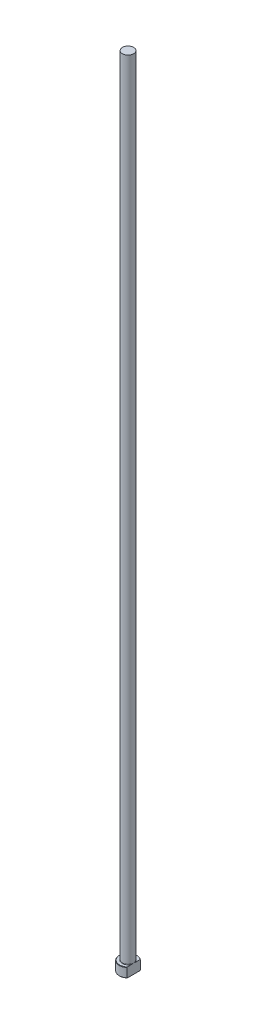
from build123d import *
from build123d.topology import SkipClean

# Parameters (mm, degrees)
CHAMFER1_SIZE    = 0.2
FILLET1_R        = 0.2
KEYED_HEAD_DEPTH = 501.06049634


with BuildPart() as part:
    # Sketch1 → Revolve1 (revolve)
    with BuildSketch(Plane.XY, mode=Mode.PRIVATE) as revolve1_sk:
        Polygon((0, 0), (-5.5, 0), (-5.5, 6), (-3.5, 6), (-3.5, 500), (0, 500), align=None)
    revolve(revolve1_sk.sketch.rotate(Axis((0, 259.958771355, 0), (0, -1, 0)), 270), axis=Axis((0, 259.958771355, 0), (0, -1, 0)))

    # Chamfer1
    chamfer1_edges = [part.edges().sort_by_distance(p)[0] for p in [
        (0, 6, -5.5),
        (0, 0, -5.5),
    ]]
    chamfer(chamfer1_edges, length=CHAMFER1_SIZE)

    # Fillet1
    fillet1_edges = [part.edges().sort_by_distance(p)[0] for p in [
        (0, 6, -3.5),
    ]]
    fillet(fillet1_edges, radius=FILLET1_R)

    # Sketch2 → KEYED HEAD (cut, through all)
    with SkipClean():  # the faces are left unmerged after this step: merging them gives an invalid solid
        with BuildSketch(Plane(origin=(0, 0, 0), x_dir=(1, 0, 0), z_dir=(0, 1, 0))):
            with BuildLine():
                Line((3.5, -4.242640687), (3.5, 4.242640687))
                ThreePointArc((3.5, 4.242640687), (5.5, 0), (3.5, -4.242640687))
            make_face()
        extrude(amount=KEYED_HEAD_DEPTH, mode=Mode.SUBTRACT)


solid = part.part
